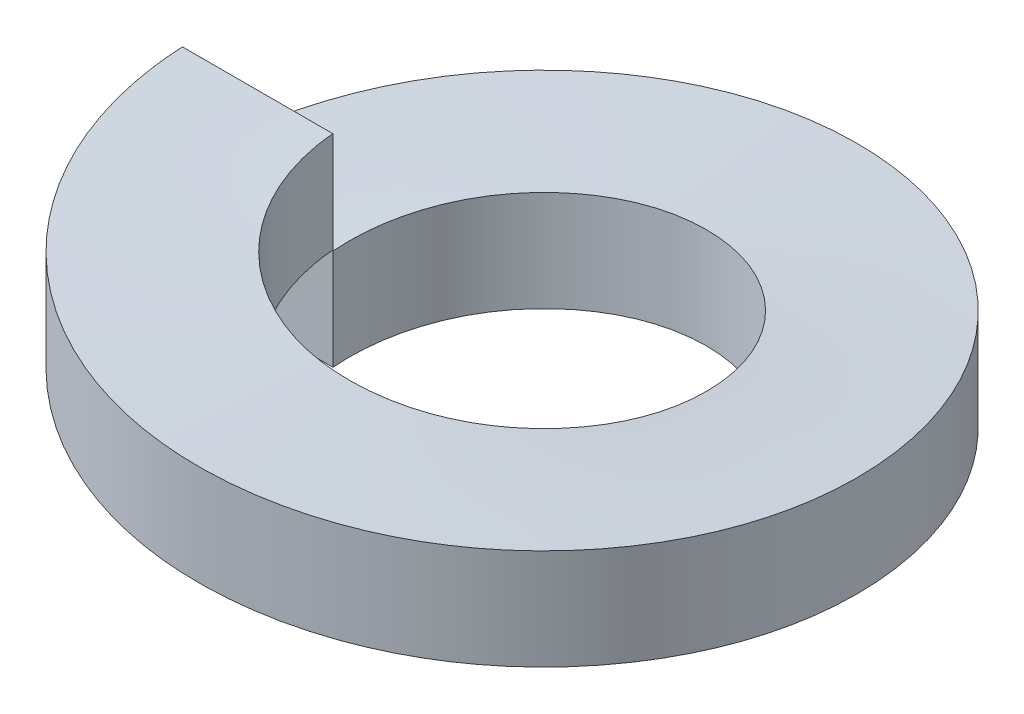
ISO-10303-21;
HEADER;
FILE_DESCRIPTION(('STEP AP214'),'2;1');
FILE_NAME('part.step','',(''),(''),'','','');
FILE_SCHEMA(('AUTOMOTIVE_DESIGN { 1 0 10303 214 1 1 1 1 }'));
ENDSEC;
DATA;
#1=APPLICATION_CONTEXT('core data for automotive mechanical design processes');
#2=APPLICATION_PROTOCOL_DEFINITION('international standard','automotive_design',2000,#1);
#3=PRODUCT_CONTEXT('',#1,'mechanical');
#4=PRODUCT('Part','Part','',(#3));
#5=PRODUCT_RELATED_PRODUCT_CATEGORY('part','',(#4));
#6=PRODUCT_DEFINITION_FORMATION('','',#4);
#7=PRODUCT_DEFINITION_CONTEXT('part definition',#1,'design');
#8=PRODUCT_DEFINITION('design','',#6,#7);
#9=PRODUCT_DEFINITION_SHAPE('','',#8);
#10=(LENGTH_UNIT() NAMED_UNIT(*) SI_UNIT(.MILLI.,.METRE.));
#11=(NAMED_UNIT(*) PLANE_ANGLE_UNIT() SI_UNIT($,.RADIAN.));
#12=(NAMED_UNIT(*) SI_UNIT($,.STERADIAN.) SOLID_ANGLE_UNIT());
#13=UNCERTAINTY_MEASURE_WITH_UNIT(LENGTH_MEASURE(1.E-05),#10,'distance_accuracy_value','');
#14=(GEOMETRIC_REPRESENTATION_CONTEXT(3) GLOBAL_UNCERTAINTY_ASSIGNED_CONTEXT((#13)) GLOBAL_UNIT_ASSIGNED_CONTEXT((#10,
#11,#12)) REPRESENTATION_CONTEXT('',''));
#15=CARTESIAN_POINT('',(0.,0.,0.));
#16=DIRECTION('',(0.,0.,1.));
#17=DIRECTION('',(1.,0.,0.));
#18=AXIS2_PLACEMENT_3D('',#15,#16,#17);
#19=CARTESIAN_POINT('',(-1.8161,0.51,0.));
#20=DIRECTION('',(0.,0.,1.));
#21=DIRECTION('',(1.,0.,0.));
#22=AXIS2_PLACEMENT_3D('',#19,#20,#21);
#23=PLANE('',#22);
#24=DIRECTION('',(0.,1.,0.));
#25=VECTOR('',#24,1.);
#26=CARTESIAN_POINT('',(-1.8161,0.51,0.));
#27=LINE('',#26,#25);
#28=CARTESIAN_POINT('',(-1.8161,0.,0.));
#29=VERTEX_POINT('',#28);
#30=CARTESIAN_POINT('',(-1.8161,1.02,0.));
#31=VERTEX_POINT('',#30);
#32=EDGE_CURVE('E44',#29,#31,#27,.T.);
#33=ORIENTED_EDGE('',*,*,#32,.T.);
#34=DIRECTION('',(-1.,0.,0.));
#35=VECTOR('',#34,1.);
#36=CARTESIAN_POINT('',(-2.5781,1.02,0.));
#37=LINE('',#36,#35);
#38=CARTESIAN_POINT('',(-3.3401,1.02,0.));
#39=VERTEX_POINT('',#38);
#40=EDGE_CURVE('E39',#31,#39,#37,.T.);
#41=ORIENTED_EDGE('',*,*,#40,.T.);
#42=DIRECTION('',(0.,-1.,0.));
#43=VECTOR('',#42,1.);
#44=CARTESIAN_POINT('',(-3.3401,0.51,0.));
#45=LINE('',#44,#43);
#46=CARTESIAN_POINT('',(-3.3401,0.,0.));
#47=VERTEX_POINT('',#46);
#48=EDGE_CURVE('E79',#39,#47,#45,.T.);
#49=ORIENTED_EDGE('',*,*,#48,.T.);
#50=DIRECTION('',(1.,0.,0.));
#51=VECTOR('',#50,1.);
#52=CARTESIAN_POINT('',(-2.5781,0.,0.));
#53=LINE('',#52,#51);
#54=EDGE_CURVE('E60',#47,#29,#53,.T.);
#55=ORIENTED_EDGE('',*,*,#54,.T.);
#56=EDGE_LOOP('',(#33,#41,#49,#55));
#57=FACE_BOUND('',#56,.T.);
#58=ADVANCED_FACE('F35',(#57),#23,.T.);
#59=CARTESIAN_POINT('',(-1.8161,1.54,0.));
#60=DIRECTION('',(0.,0.,-1.));
#61=DIRECTION('',(-1.,0.,0.));
#62=AXIS2_PLACEMENT_3D('',#59,#60,#61);
#63=PLANE('',#62);
#64=DIRECTION('',(0.,-1.,0.));
#65=VECTOR('',#64,1.);
#66=CARTESIAN_POINT('',(-1.8161,1.54,0.));
#67=LINE('',#66,#65);
#68=CARTESIAN_POINT('',(-1.8161,2.05,0.));
#69=VERTEX_POINT('',#68);
#70=CARTESIAN_POINT('',(-1.8161,1.03,0.));
#71=VERTEX_POINT('',#70);
#72=EDGE_CURVE('E11',#69,#71,#67,.T.);
#73=ORIENTED_EDGE('',*,*,#72,.T.);
#74=DIRECTION('',(-1.,0.,0.));
#75=VECTOR('',#74,1.);
#76=CARTESIAN_POINT('',(-2.5781,1.03,0.));
#77=LINE('',#76,#75);
#78=CARTESIAN_POINT('',(-3.3401,1.03,0.));
#79=VERTEX_POINT('',#78);
#80=EDGE_CURVE('E184',#71,#79,#77,.T.);
#81=ORIENTED_EDGE('',*,*,#80,.T.);
#82=DIRECTION('',(0.,1.,0.));
#83=VECTOR('',#82,1.);
#84=CARTESIAN_POINT('',(-3.3401,1.54,0.));
#85=LINE('',#84,#83);
#86=CARTESIAN_POINT('',(-3.3401,2.05,0.));
#87=VERTEX_POINT('',#86);
#88=EDGE_CURVE('E96',#79,#87,#85,.T.);
#89=ORIENTED_EDGE('',*,*,#88,.T.);
#90=DIRECTION('',(1.,0.,0.));
#91=VECTOR('',#90,1.);
#92=CARTESIAN_POINT('',(-2.5781,2.05,0.));
#93=LINE('',#92,#91);
#94=EDGE_CURVE('E84',#87,#69,#93,.T.);
#95=ORIENTED_EDGE('',*,*,#94,.T.);
#96=EDGE_LOOP('',(#73,#81,#89,#95));
#97=FACE_BOUND('',#96,.T.);
#98=ADVANCED_FACE('F37',(#97),#63,.T.);
#99=CARTESIAN_POINT('',(-1.8161,0.,0.));
#100=CARTESIAN_POINT('',(-1.8161,0.064375,-0.752253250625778));
#101=CARTESIAN_POINT('',(-1.28417662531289,0.12875,-1.28417662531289));
#102=CARTESIAN_POINT('',(-0.752253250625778,0.193125,-1.8161));
#103=CARTESIAN_POINT('',(0.,0.2575,-1.8161));
#104=CARTESIAN_POINT('',(0.752253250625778,0.321875,-1.8161));
#105=CARTESIAN_POINT('',(1.28417662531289,0.38625,-1.28417662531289));
#106=CARTESIAN_POINT('',(1.8161,0.450625,-0.752253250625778));
#107=CARTESIAN_POINT('',(1.8161,0.515,0.));
#108=CARTESIAN_POINT('',(1.8161,0.579375,0.752253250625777));
#109=CARTESIAN_POINT('',(1.28417662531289,0.64375,1.28417662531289));
#110=CARTESIAN_POINT('',(0.752253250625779,0.708125,1.8161));
#111=CARTESIAN_POINT('',(0.,0.7725,1.8161));
#112=CARTESIAN_POINT('',(-0.752253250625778,0.836875,1.8161));
#113=CARTESIAN_POINT('',(-1.28417662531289,0.90125,1.28417662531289));
#114=CARTESIAN_POINT('',(-1.8161,0.965625,0.752253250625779));
#115=CARTESIAN_POINT('',(-1.8161,1.03,0.));
#116=CARTESIAN_POINT('',(-1.8161,1.02,0.));
#117=CARTESIAN_POINT('',(-1.8161,1.084375,-0.752253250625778));
#118=CARTESIAN_POINT('',(-1.28417662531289,1.14875,-1.28417662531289));
#119=CARTESIAN_POINT('',(-0.752253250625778,1.213125,-1.8161));
#120=CARTESIAN_POINT('',(0.,1.2775,-1.8161));
#121=CARTESIAN_POINT('',(0.752253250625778,1.341875,-1.8161));
#122=CARTESIAN_POINT('',(1.28417662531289,1.40625,-1.28417662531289));
#123=CARTESIAN_POINT('',(1.8161,1.470625,-0.752253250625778));
#124=CARTESIAN_POINT('',(1.8161,1.535,0.));
#125=CARTESIAN_POINT('',(1.8161,1.599375,0.752253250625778));
#126=CARTESIAN_POINT('',(1.28417662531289,1.66375,1.28417662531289));
#127=CARTESIAN_POINT('',(0.752253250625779,1.728125,1.8161));
#128=CARTESIAN_POINT('',(0.,1.7925,1.8161));
#129=CARTESIAN_POINT('',(-0.752253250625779,1.856875,1.8161));
#130=CARTESIAN_POINT('',(-1.28417662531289,1.92125,1.28417662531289));
#131=CARTESIAN_POINT('',(-1.8161,1.985625,0.752253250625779));
#132=CARTESIAN_POINT('',(-1.8161,2.05,0.));
#133=(BOUNDED_SURFACE() B_SPLINE_SURFACE(1,2,((#99,#100,#101,#102,#103,#104,#105,#106,#107,#108,
#109,#110,#111,#112,#113,#114,#115),(#116,#117,#118,#119,#120,#121,#122,#123,#124,#125,#126,
#127,#128,#129,#130,#131,#132)),.UNSPECIFIED.,.F.,.F.,.F.) B_SPLINE_SURFACE_WITH_KNOTS((2,2),(3,
2,2,2,2,2,2,2,3),(0.,1.),(0.,0.125,0.25,0.375,0.5,0.625,0.75,0.875,1.),
.UNSPECIFIED.) GEOMETRIC_REPRESENTATION_ITEM() RATIONAL_B_SPLINE_SURFACE(((1.,0.923879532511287,
1.,0.923879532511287,1.,0.923879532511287,1.,0.923879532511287,1.,0.923879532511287,1.,
0.923879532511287,1.,0.923879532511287,1.,0.923879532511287,1.),(1.,0.923879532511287,1.,
0.923879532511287,1.,0.923879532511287,1.,0.923879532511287,1.,0.923879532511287,1.,
0.923879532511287,1.,0.923879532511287,1.,0.923879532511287,1.))) REPRESENTATION_ITEM('') SURFACE());
#134=CARTESIAN_POINT('',(-1.8161,0.,0.));
#135=CARTESIAN_POINT('',(-1.8161,0.064375,-0.752253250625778));
#136=CARTESIAN_POINT('',(-1.28417662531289,0.12875,-1.28417662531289));
#137=CARTESIAN_POINT('',(-0.752253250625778,0.193125,-1.8161));
#138=CARTESIAN_POINT('',(0.,0.2575,-1.8161));
#139=CARTESIAN_POINT('',(0.752253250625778,0.321875,-1.8161));
#140=CARTESIAN_POINT('',(1.28417662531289,0.38625,-1.28417662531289));
#141=CARTESIAN_POINT('',(1.8161,0.450625,-0.752253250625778));
#142=CARTESIAN_POINT('',(1.8161,0.515,0.));
#143=CARTESIAN_POINT('',(1.8161,0.579375,0.752253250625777));
#144=CARTESIAN_POINT('',(1.28417662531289,0.64375,1.28417662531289));
#145=CARTESIAN_POINT('',(0.752253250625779,0.708125,1.8161));
#146=CARTESIAN_POINT('',(0.,0.7725,1.8161));
#147=CARTESIAN_POINT('',(-0.752253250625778,0.836875,1.8161));
#148=CARTESIAN_POINT('',(-1.28417662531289,0.90125,1.28417662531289));
#149=CARTESIAN_POINT('',(-1.8161,0.965625,0.752253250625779));
#150=CARTESIAN_POINT('',(-1.8161,1.03,0.));
#151=(BOUNDED_CURVE() B_SPLINE_CURVE(2,(#134,#135,#136,#137,#138,#139,#140,#141,#142,#143,#144,
#145,#146,#147,#148,#149,#150),.UNSPECIFIED.,.F.,.F.) B_SPLINE_CURVE_WITH_KNOTS((3,2,2,2,2,2,2,
2,3),(0.,0.125,0.25,0.375,0.5,0.625,0.75,0.875,1.),
.UNSPECIFIED.) CURVE() GEOMETRIC_REPRESENTATION_ITEM() RATIONAL_B_SPLINE_CURVE((1.,
0.923879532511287,1.,0.923879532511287,1.,0.923879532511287,1.,0.923879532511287,1.,
0.923879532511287,1.,0.923879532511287,1.,0.923879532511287,1.,0.923879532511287,1.)) REPRESENTATION_ITEM(''));
#152=EDGE_CURVE('E52',#29,#71,#151,.T.);
#153=CARTESIAN_POINT('',(-1.8161,1.02,0.));
#154=CARTESIAN_POINT('',(-1.8161,1.084375,-0.752253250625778));
#155=CARTESIAN_POINT('',(-1.28417662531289,1.14875,-1.28417662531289));
#156=CARTESIAN_POINT('',(-0.752253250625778,1.213125,-1.8161));
#157=CARTESIAN_POINT('',(0.,1.2775,-1.8161));
#158=CARTESIAN_POINT('',(0.752253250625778,1.341875,-1.8161));
#159=CARTESIAN_POINT('',(1.28417662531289,1.40625,-1.28417662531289));
#160=CARTESIAN_POINT('',(1.8161,1.470625,-0.752253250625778));
#161=CARTESIAN_POINT('',(1.8161,1.535,0.));
#162=CARTESIAN_POINT('',(1.8161,1.599375,0.752253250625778));
#163=CARTESIAN_POINT('',(1.28417662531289,1.66375,1.28417662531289));
#164=CARTESIAN_POINT('',(0.752253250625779,1.728125,1.8161));
#165=CARTESIAN_POINT('',(0.,1.7925,1.8161));
#166=CARTESIAN_POINT('',(-0.752253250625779,1.856875,1.8161));
#167=CARTESIAN_POINT('',(-1.28417662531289,1.92125,1.28417662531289));
#168=CARTESIAN_POINT('',(-1.8161,1.985625,0.752253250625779));
#169=CARTESIAN_POINT('',(-1.8161,2.05,0.));
#170=(BOUNDED_CURVE() B_SPLINE_CURVE(2,(#153,#154,#155,#156,#157,#158,#159,#160,#161,#162,#163,
#164,#165,#166,#167,#168,#169),.UNSPECIFIED.,.F.,.F.) B_SPLINE_CURVE_WITH_KNOTS((3,2,2,2,2,2,2,
2,3),(0.,0.125,0.25,0.375,0.5,0.625,0.75,0.875,1.),
.UNSPECIFIED.) CURVE() GEOMETRIC_REPRESENTATION_ITEM() RATIONAL_B_SPLINE_CURVE((1.,
0.923879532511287,1.,0.923879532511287,1.,0.923879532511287,1.,0.923879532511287,1.,
0.923879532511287,1.,0.923879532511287,1.,0.923879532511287,1.,0.923879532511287,1.)) REPRESENTATION_ITEM(''));
#171=EDGE_CURVE('E91',#31,#69,#170,.T.);
#172=ORIENTED_EDGE('',*,*,#32,.F.);
#173=ORIENTED_EDGE('',*,*,#152,.T.);
#174=ORIENTED_EDGE('',*,*,#72,.F.);
#175=ORIENTED_EDGE('',*,*,#171,.F.);
#176=EDGE_LOOP('',(#172,#173,#174,#175));
#177=FACE_BOUND('',#176,.T.);
#178=ADVANCED_FACE('F103',(#177),#133,.F.);
#179=CARTESIAN_POINT('',(-3.3401,0.,0.));
#180=CARTESIAN_POINT('',(-3.3401,0.0643749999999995,-1.38351471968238));
#181=CARTESIAN_POINT('',(-2.36180735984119,0.12875,-2.36180735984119));
#182=CARTESIAN_POINT('',(-1.38351471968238,0.193125,-3.3401));
#183=CARTESIAN_POINT('',(0.,0.2575,-3.3401));
#184=CARTESIAN_POINT('',(1.38351471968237,0.321875,-3.3401));
#185=CARTESIAN_POINT('',(2.36180735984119,0.38625,-2.36180735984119));
#186=CARTESIAN_POINT('',(3.3401,0.450625,-1.38351471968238));
#187=CARTESIAN_POINT('',(3.3401,0.515,0.));
#188=CARTESIAN_POINT('',(3.3401,0.579375,1.38351471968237));
#189=CARTESIAN_POINT('',(2.36180735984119,0.64375,2.36180735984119));
#190=CARTESIAN_POINT('',(1.38351471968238,0.708125,3.3401));
#191=CARTESIAN_POINT('',(0.,0.7725,3.3401));
#192=CARTESIAN_POINT('',(-1.38351471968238,0.836875,3.3401));
#193=CARTESIAN_POINT('',(-2.36180735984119,0.90125,2.36180735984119));
#194=CARTESIAN_POINT('',(-3.3401,0.965625,1.38351471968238));
#195=CARTESIAN_POINT('',(-3.3401,1.03,0.));
#196=CARTESIAN_POINT('',(-1.8161,0.,0.));
#197=CARTESIAN_POINT('',(-1.8161,0.064375,-0.752253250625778));
#198=CARTESIAN_POINT('',(-1.28417662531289,0.12875,-1.28417662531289));
#199=CARTESIAN_POINT('',(-0.752253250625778,0.193125,-1.8161));
#200=CARTESIAN_POINT('',(0.,0.2575,-1.8161));
#201=CARTESIAN_POINT('',(0.752253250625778,0.321875,-1.8161));
#202=CARTESIAN_POINT('',(1.28417662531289,0.38625,-1.28417662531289));
#203=CARTESIAN_POINT('',(1.8161,0.450625,-0.752253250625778));
#204=CARTESIAN_POINT('',(1.8161,0.515,0.));
#205=CARTESIAN_POINT('',(1.8161,0.579375,0.752253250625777));
#206=CARTESIAN_POINT('',(1.28417662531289,0.64375,1.28417662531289));
#207=CARTESIAN_POINT('',(0.752253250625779,0.708125,1.8161));
#208=CARTESIAN_POINT('',(0.,0.7725,1.8161));
#209=CARTESIAN_POINT('',(-0.752253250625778,0.836875,1.8161));
#210=CARTESIAN_POINT('',(-1.28417662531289,0.90125,1.28417662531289));
#211=CARTESIAN_POINT('',(-1.8161,0.965625,0.752253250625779));
#212=CARTESIAN_POINT('',(-1.8161,1.03,0.));
#213=(BOUNDED_SURFACE() B_SPLINE_SURFACE(1,2,((#179,#180,#181,#182,#183,#184,#185,#186,#187,
#188,#189,#190,#191,#192,#193,#194,#195),(#196,#197,#198,#199,#200,#201,#202,#203,#204,#205,
#206,#207,#208,#209,#210,#211,#212)),.UNSPECIFIED.,.F.,.F.,.F.) B_SPLINE_SURFACE_WITH_KNOTS((2,
2),(3,2,2,2,2,2,2,2,3),(0.,1.),(0.,0.125,0.25,0.375,0.5,0.625,0.75,0.875,1.),
.UNSPECIFIED.) GEOMETRIC_REPRESENTATION_ITEM() RATIONAL_B_SPLINE_SURFACE(((1.,0.923879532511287,
1.,0.923879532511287,1.,0.923879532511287,1.,0.923879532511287,1.,0.923879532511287,1.,
0.923879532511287,1.,0.923879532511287,1.,0.923879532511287,1.),(1.,0.923879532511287,1.,
0.923879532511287,1.,0.923879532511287,1.,0.923879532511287,1.,0.923879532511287,1.,
0.923879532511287,1.,0.923879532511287,1.,0.923879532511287,1.))) REPRESENTATION_ITEM('') SURFACE());
#214=CARTESIAN_POINT('',(-3.3401,0.,0.));
#215=CARTESIAN_POINT('',(-3.3401,0.0643749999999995,-1.38351471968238));
#216=CARTESIAN_POINT('',(-2.36180735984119,0.12875,-2.36180735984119));
#217=CARTESIAN_POINT('',(-1.38351471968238,0.193125,-3.3401));
#218=CARTESIAN_POINT('',(0.,0.2575,-3.3401));
#219=CARTESIAN_POINT('',(1.38351471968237,0.321875,-3.3401));
#220=CARTESIAN_POINT('',(2.36180735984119,0.38625,-2.36180735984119));
#221=CARTESIAN_POINT('',(3.3401,0.450625,-1.38351471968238));
#222=CARTESIAN_POINT('',(3.3401,0.515,0.));
#223=CARTESIAN_POINT('',(3.3401,0.579375,1.38351471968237));
#224=CARTESIAN_POINT('',(2.36180735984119,0.64375,2.36180735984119));
#225=CARTESIAN_POINT('',(1.38351471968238,0.708125,3.3401));
#226=CARTESIAN_POINT('',(0.,0.7725,3.3401));
#227=CARTESIAN_POINT('',(-1.38351471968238,0.836875,3.3401));
#228=CARTESIAN_POINT('',(-2.36180735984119,0.90125,2.36180735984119));
#229=CARTESIAN_POINT('',(-3.3401,0.965625,1.38351471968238));
#230=CARTESIAN_POINT('',(-3.3401,1.03,0.));
#231=(BOUNDED_CURVE() B_SPLINE_CURVE(2,(#214,#215,#216,#217,#218,#219,#220,#221,#222,#223,#224,
#225,#226,#227,#228,#229,#230),.UNSPECIFIED.,.F.,.F.) B_SPLINE_CURVE_WITH_KNOTS((3,2,2,2,2,2,2,
2,3),(0.,0.125,0.25,0.375,0.5,0.625,0.75,0.875,1.),
.UNSPECIFIED.) CURVE() GEOMETRIC_REPRESENTATION_ITEM() RATIONAL_B_SPLINE_CURVE((1.,
0.923879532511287,1.,0.923879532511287,1.,0.923879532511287,1.,0.923879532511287,1.,
0.923879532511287,1.,0.923879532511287,1.,0.923879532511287,1.,0.923879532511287,1.)) REPRESENTATION_ITEM(''));
#232=EDGE_CURVE('E94',#47,#79,#231,.T.);
#233=ORIENTED_EDGE('',*,*,#54,.F.);
#234=ORIENTED_EDGE('',*,*,#232,.T.);
#235=ORIENTED_EDGE('',*,*,#80,.F.);
#236=ORIENTED_EDGE('',*,*,#152,.F.);
#237=EDGE_LOOP('',(#233,#234,#235,#236));
#238=FACE_BOUND('',#237,.T.);
#239=ADVANCED_FACE('F105',(#238),#213,.F.);
#240=CARTESIAN_POINT('',(-3.3401,1.02,0.));
#241=CARTESIAN_POINT('',(-3.3401,1.084375,-1.38351471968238));
#242=CARTESIAN_POINT('',(-2.36180735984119,1.14875,-2.36180735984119));
#243=CARTESIAN_POINT('',(-1.38351471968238,1.213125,-3.3401));
#244=CARTESIAN_POINT('',(0.,1.2775,-3.3401));
#245=CARTESIAN_POINT('',(1.38351471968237,1.341875,-3.3401));
#246=CARTESIAN_POINT('',(2.36180735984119,1.40625,-2.36180735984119));
#247=CARTESIAN_POINT('',(3.3401,1.470625,-1.38351471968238));
#248=CARTESIAN_POINT('',(3.3401,1.535,0.));
#249=CARTESIAN_POINT('',(3.3401,1.599375,1.38351471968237));
#250=CARTESIAN_POINT('',(2.36180735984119,1.66375,2.36180735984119));
#251=CARTESIAN_POINT('',(1.38351471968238,1.728125,3.3401));
#252=CARTESIAN_POINT('',(0.,1.7925,3.3401));
#253=CARTESIAN_POINT('',(-1.38351471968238,1.856875,3.3401));
#254=CARTESIAN_POINT('',(-2.36180735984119,1.92125,2.36180735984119));
#255=CARTESIAN_POINT('',(-3.3401,1.985625,1.38351471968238));
#256=CARTESIAN_POINT('',(-3.3401,2.05,0.));
#257=CARTESIAN_POINT('',(-3.3401,0.,0.));
#258=CARTESIAN_POINT('',(-3.3401,0.0643749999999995,-1.38351471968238));
#259=CARTESIAN_POINT('',(-2.36180735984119,0.12875,-2.36180735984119));
#260=CARTESIAN_POINT('',(-1.38351471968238,0.193125,-3.3401));
#261=CARTESIAN_POINT('',(0.,0.2575,-3.3401));
#262=CARTESIAN_POINT('',(1.38351471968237,0.321875,-3.3401));
#263=CARTESIAN_POINT('',(2.36180735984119,0.38625,-2.36180735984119));
#264=CARTESIAN_POINT('',(3.3401,0.450625,-1.38351471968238));
#265=CARTESIAN_POINT('',(3.3401,0.515,0.));
#266=CARTESIAN_POINT('',(3.3401,0.579375,1.38351471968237));
#267=CARTESIAN_POINT('',(2.36180735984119,0.64375,2.36180735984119));
#268=CARTESIAN_POINT('',(1.38351471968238,0.708125,3.3401));
#269=CARTESIAN_POINT('',(0.,0.7725,3.3401));
#270=CARTESIAN_POINT('',(-1.38351471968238,0.836875,3.3401));
#271=CARTESIAN_POINT('',(-2.36180735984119,0.90125,2.36180735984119));
#272=CARTESIAN_POINT('',(-3.3401,0.965625,1.38351471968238));
#273=CARTESIAN_POINT('',(-3.3401,1.03,0.));
#274=(BOUNDED_SURFACE() B_SPLINE_SURFACE(1,2,((#240,#241,#242,#243,#244,#245,#246,#247,#248,
#249,#250,#251,#252,#253,#254,#255,#256),(#257,#258,#259,#260,#261,#262,#263,#264,#265,#266,
#267,#268,#269,#270,#271,#272,#273)),.UNSPECIFIED.,.F.,.F.,.F.) B_SPLINE_SURFACE_WITH_KNOTS((2,
2),(3,2,2,2,2,2,2,2,3),(0.,1.),(0.,0.125,0.25,0.375,0.5,0.625,0.75,0.875,1.),
.UNSPECIFIED.) GEOMETRIC_REPRESENTATION_ITEM() RATIONAL_B_SPLINE_SURFACE(((1.,0.923879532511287,
1.,0.923879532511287,1.,0.923879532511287,1.,0.923879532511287,1.,0.923879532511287,1.,
0.923879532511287,1.,0.923879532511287,1.,0.923879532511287,1.),(1.,0.923879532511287,1.,
0.923879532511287,1.,0.923879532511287,1.,0.923879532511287,1.,0.923879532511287,1.,
0.923879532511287,1.,0.923879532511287,1.,0.923879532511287,1.))) REPRESENTATION_ITEM('') SURFACE());
#275=CARTESIAN_POINT('',(-3.3401,1.02,0.));
#276=CARTESIAN_POINT('',(-3.3401,1.084375,-1.38351471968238));
#277=CARTESIAN_POINT('',(-2.36180735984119,1.14875,-2.36180735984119));
#278=CARTESIAN_POINT('',(-1.38351471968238,1.213125,-3.3401));
#279=CARTESIAN_POINT('',(0.,1.2775,-3.3401));
#280=CARTESIAN_POINT('',(1.38351471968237,1.341875,-3.3401));
#281=CARTESIAN_POINT('',(2.36180735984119,1.40625,-2.36180735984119));
#282=CARTESIAN_POINT('',(3.3401,1.470625,-1.38351471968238));
#283=CARTESIAN_POINT('',(3.3401,1.535,0.));
#284=CARTESIAN_POINT('',(3.3401,1.599375,1.38351471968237));
#285=CARTESIAN_POINT('',(2.36180735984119,1.66375,2.36180735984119));
#286=CARTESIAN_POINT('',(1.38351471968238,1.728125,3.3401));
#287=CARTESIAN_POINT('',(0.,1.7925,3.3401));
#288=CARTESIAN_POINT('',(-1.38351471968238,1.856875,3.3401));
#289=CARTESIAN_POINT('',(-2.36180735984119,1.92125,2.36180735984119));
#290=CARTESIAN_POINT('',(-3.3401,1.985625,1.38351471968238));
#291=CARTESIAN_POINT('',(-3.3401,2.05,0.));
#292=(BOUNDED_CURVE() B_SPLINE_CURVE(2,(#275,#276,#277,#278,#279,#280,#281,#282,#283,#284,#285,
#286,#287,#288,#289,#290,#291),.UNSPECIFIED.,.F.,.F.) B_SPLINE_CURVE_WITH_KNOTS((3,2,2,2,2,2,2,
2,3),(0.,0.125,0.25,0.375,0.5,0.625,0.75,0.875,1.),
.UNSPECIFIED.) CURVE() GEOMETRIC_REPRESENTATION_ITEM() RATIONAL_B_SPLINE_CURVE((1.,
0.923879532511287,1.,0.923879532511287,1.,0.923879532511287,1.,0.923879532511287,1.,
0.923879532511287,1.,0.923879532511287,1.,0.923879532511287,1.,0.923879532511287,1.)) REPRESENTATION_ITEM(''));
#293=EDGE_CURVE('E86',#39,#87,#292,.T.);
#294=ORIENTED_EDGE('',*,*,#48,.F.);
#295=ORIENTED_EDGE('',*,*,#293,.T.);
#296=ORIENTED_EDGE('',*,*,#88,.F.);
#297=ORIENTED_EDGE('',*,*,#232,.F.);
#298=EDGE_LOOP('',(#294,#295,#296,#297));
#299=FACE_BOUND('',#298,.T.);
#300=ADVANCED_FACE('F93',(#299),#274,.F.);
#301=CARTESIAN_POINT('',(-1.8161,1.02,0.));
#302=CARTESIAN_POINT('',(-1.8161,1.084375,-0.752253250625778));
#303=CARTESIAN_POINT('',(-1.28417662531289,1.14875,-1.28417662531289));
#304=CARTESIAN_POINT('',(-0.752253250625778,1.213125,-1.8161));
#305=CARTESIAN_POINT('',(0.,1.2775,-1.8161));
#306=CARTESIAN_POINT('',(0.752253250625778,1.341875,-1.8161));
#307=CARTESIAN_POINT('',(1.28417662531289,1.40625,-1.28417662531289));
#308=CARTESIAN_POINT('',(1.8161,1.470625,-0.752253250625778));
#309=CARTESIAN_POINT('',(1.8161,1.535,0.));
#310=CARTESIAN_POINT('',(1.8161,1.599375,0.752253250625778));
#311=CARTESIAN_POINT('',(1.28417662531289,1.66375,1.28417662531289));
#312=CARTESIAN_POINT('',(0.752253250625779,1.728125,1.8161));
#313=CARTESIAN_POINT('',(0.,1.7925,1.8161));
#314=CARTESIAN_POINT('',(-0.752253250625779,1.856875,1.8161));
#315=CARTESIAN_POINT('',(-1.28417662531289,1.92125,1.28417662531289));
#316=CARTESIAN_POINT('',(-1.8161,1.985625,0.752253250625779));
#317=CARTESIAN_POINT('',(-1.8161,2.05,0.));
#318=CARTESIAN_POINT('',(-3.3401,1.02,0.));
#319=CARTESIAN_POINT('',(-3.3401,1.084375,-1.38351471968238));
#320=CARTESIAN_POINT('',(-2.36180735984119,1.14875,-2.36180735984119));
#321=CARTESIAN_POINT('',(-1.38351471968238,1.213125,-3.3401));
#322=CARTESIAN_POINT('',(0.,1.2775,-3.3401));
#323=CARTESIAN_POINT('',(1.38351471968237,1.341875,-3.3401));
#324=CARTESIAN_POINT('',(2.36180735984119,1.40625,-2.36180735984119));
#325=CARTESIAN_POINT('',(3.3401,1.470625,-1.38351471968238));
#326=CARTESIAN_POINT('',(3.3401,1.535,0.));
#327=CARTESIAN_POINT('',(3.3401,1.599375,1.38351471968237));
#328=CARTESIAN_POINT('',(2.36180735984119,1.66375,2.36180735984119));
#329=CARTESIAN_POINT('',(1.38351471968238,1.728125,3.3401));
#330=CARTESIAN_POINT('',(0.,1.7925,3.3401));
#331=CARTESIAN_POINT('',(-1.38351471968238,1.856875,3.3401));
#332=CARTESIAN_POINT('',(-2.36180735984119,1.92125,2.36180735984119));
#333=CARTESIAN_POINT('',(-3.3401,1.985625,1.38351471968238));
#334=CARTESIAN_POINT('',(-3.3401,2.05,0.));
#335=(BOUNDED_SURFACE() B_SPLINE_SURFACE(1,2,((#301,#302,#303,#304,#305,#306,#307,#308,#309,
#310,#311,#312,#313,#314,#315,#316,#317),(#318,#319,#320,#321,#322,#323,#324,#325,#326,#327,
#328,#329,#330,#331,#332,#333,#334)),.UNSPECIFIED.,.F.,.F.,.F.) B_SPLINE_SURFACE_WITH_KNOTS((2,
2),(3,2,2,2,2,2,2,2,3),(0.,1.),(0.,0.125,0.25,0.375,0.5,0.625,0.75,0.875,1.),
.UNSPECIFIED.) GEOMETRIC_REPRESENTATION_ITEM() RATIONAL_B_SPLINE_SURFACE(((1.,0.923879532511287,
1.,0.923879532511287,1.,0.923879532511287,1.,0.923879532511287,1.,0.923879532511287,1.,
0.923879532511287,1.,0.923879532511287,1.,0.923879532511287,1.),(1.,0.923879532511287,1.,
0.923879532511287,1.,0.923879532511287,1.,0.923879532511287,1.,0.923879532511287,1.,
0.923879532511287,1.,0.923879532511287,1.,0.923879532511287,1.))) REPRESENTATION_ITEM('') SURFACE());
#336=ORIENTED_EDGE('',*,*,#40,.F.);
#337=ORIENTED_EDGE('',*,*,#171,.T.);
#338=ORIENTED_EDGE('',*,*,#94,.F.);
#339=ORIENTED_EDGE('',*,*,#293,.F.);
#340=EDGE_LOOP('',(#336,#337,#338,#339));
#341=FACE_BOUND('',#340,.T.);
#342=ADVANCED_FACE('F87',(#341),#335,.F.);
#343=CLOSED_SHELL('',(#58,#98,#178,#239,#300,#342));
#344=MANIFOLD_SOLID_BREP('B2',#343);
#345=ADVANCED_BREP_SHAPE_REPRESENTATION('',(#18,#344),#14);
#346=SHAPE_DEFINITION_REPRESENTATION(#9,#345);
ENDSEC;
END-ISO-10303-21;
